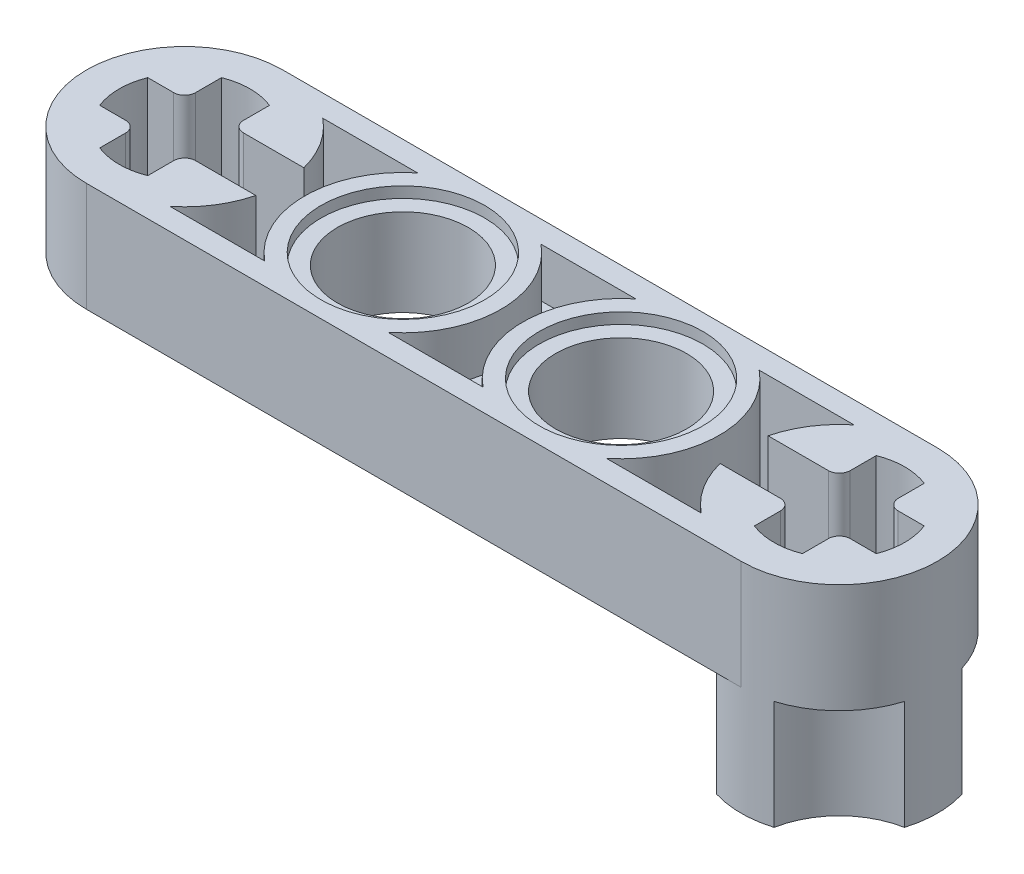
from build123d import *
from build123d.topology import SkipClean

# Parameters (mm, degrees)
SKETCH1_R           = 2.4
BOSS_EXTRUDE1_DEPTH = 4
CUT_EXTRUDE1_START  = -1.8
CUT_EXTRUDE1_DEPTH  = 1.8
SKETCH3_R           = 3
CUT_EXTRUDE2_DEPTH  = 0.4
BOSS_EXTRUDE2_START = 4
SKETCH4_R           = 2.4
BOSS_EXTRUDE2_DEPTH = 4


with BuildPart() as part:
    # Sketch1 → Boss-Extrude1 (new body)
    with BuildSketch(Plane(origin=(0, 0, 0), x_dir=(1, 0, 0), z_dir=(0, 1, 0))):
        with BuildLine():
            Line((-12, 3.6), (12, 3.6))
            ThreePointArc((12, 3.6), (15.6, 0), (12, -3.6))
            Line((12, -3.6), (-12, -3.6))
            ThreePointArc((-12, -3.6), (-15.6, 0), (-12, 3.6))
        make_face()
        with Locations(Location((-4, 0, 0), (0, 0, 270))):
            Circle(SKETCH1_R, mode=Mode.SUBTRACT)
        with Locations(Location((4, 0, 0), (0, 0, 270))):
            Circle(SKETCH1_R, mode=Mode.SUBTRACT)
        with BuildLine():
            Line((-14.232845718, 0.88), (-13.28, 0.88))
            ThreePointArc((-13.28, 0.88), (-12.997157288, 0.997157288), (-12.88, 1.28))
            Line((-12.88, 1.28), (-12.88, 2.232845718))
            ThreePointArc((-12.88, 2.232845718), (-12, 2.4), (-11.12, 2.232845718))
            Line((-11.12, 2.232845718), (-11.12, 1.28))
            ThreePointArc((-11.12, 1.28), (-11.002842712, 0.997157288), (-10.72, 0.88))
            Line((-10.72, 0.88), (-9.767154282, 0.88))
            Line((-9.767154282, 0.88), (-8.509212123, 0.88))
            ThreePointArc((-8.509212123, 0.88), (-8.967282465, 1.939748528), (-9.7372583, 2.8))
            Line((-9.7372583, 2.8), (-6.2627417, 2.8))
            ThreePointArc((-6.2627417, 2.8), (-7.6, 0), (-6.2627417, -2.8))
            Line((-6.2627417, -2.8), (-9.7372583, -2.8))
            ThreePointArc((-9.7372583, -2.8), (-8.967282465, -1.939748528), (-8.509212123, -0.88))
            Line((-8.509212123, -0.88), (-9.767154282, -0.88))
            Line((-9.767154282, -0.88), (-10.72, -0.88))
            ThreePointArc((-10.72, -0.88), (-11.002842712, -0.997157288), (-11.12, -1.28))
            Line((-11.12, -1.28), (-11.12, -2.232845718))
            ThreePointArc((-11.12, -2.232845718), (-12, -2.4), (-12.88, -2.232845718))
            Line((-12.88, -2.232845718), (-12.88, -1.28))
            ThreePointArc((-12.88, -1.28), (-12.997157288, -0.997157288), (-13.28, -0.88))
            Line((-13.28, -0.88), (-14.232845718, -0.88))
            ThreePointArc((-14.232845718, -0.88), (-14.4, 0), (-14.232845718, 0.88))
        make_face(mode=Mode.SUBTRACT)
        with BuildLine():
            Line((11.12, 2.232845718), (11.12, 1.28))
            ThreePointArc((11.12, 1.28), (11.002842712, 0.997157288), (10.72, 0.88))
            Line((10.72, 0.88), (9.767154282, 0.88))
            Line((9.767154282, 0.88), (8.509212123, 0.88))
            ThreePointArc((8.509212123, 0.88), (8.967282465, 1.939748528), (9.7372583, 2.8))
            Line((9.7372583, 2.8), (6.2627417, 2.8))
            ThreePointArc((6.2627417, 2.8), (7.6, 0), (6.2627417, -2.8))
            Line((6.2627417, -2.8), (9.7372583, -2.8))
            ThreePointArc((9.7372583, -2.8), (8.967282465, -1.939748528), (8.509212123, -0.88))
            Line((8.509212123, -0.88), (9.767154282, -0.88))
            Line((9.767154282, -0.88), (10.72, -0.88))
            ThreePointArc((10.72, -0.88), (11.002842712, -0.997157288), (11.12, -1.28))
            Line((11.12, -1.28), (11.12, -2.232845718))
            ThreePointArc((11.12, -2.232845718), (12, -2.4), (12.88, -2.232845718))
            Line((12.88, -2.232845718), (12.88, -1.28))
            ThreePointArc((12.88, -1.28), (12.997157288, -0.997157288), (13.28, -0.88))
            Line((13.28, -0.88), (14.232845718, -0.88))
            ThreePointArc((14.232845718, -0.88), (14.4, 0), (14.232845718, 0.88))
            Line((14.232845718, 0.88), (13.28, 0.88))
            ThreePointArc((13.28, 0.88), (12.997157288, 0.997157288), (12.88, 1.28))
            Line((12.88, 1.28), (12.88, 2.232845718))
            ThreePointArc((12.88, 2.232845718), (12, 2.4), (11.12, 2.232845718))
        make_face(mode=Mode.SUBTRACT)
    extrude(amount=BOSS_EXTRUDE1_DEPTH)

    # Sketch2 → Cut-Extrude1 (cut)
    with BuildSketch(Plane(origin=(0, 4, 0), x_dir=(1, 0, 0), z_dir=(0, 1, 0)).offset(CUT_EXTRUDE1_START)):
        with BuildLine():
            Line((-1.7372583, 2.8), (1.7372583, 2.8))
            ThreePointArc((1.7372583, 2.8), (0.4, 0), (1.7372583, -2.8))
            Line((1.7372583, -2.8), (-1.7372583, -2.8))
            ThreePointArc((-1.7372583, -2.8), (-0.4, 0), (-1.7372583, 2.8))
        make_face()
    cut_extrude1 = extrude(amount=CUT_EXTRUDE1_DEPTH, mode=Mode.SUBTRACT)

    # Mirror1: Cut-Extrude1 across plane
    add(cut_extrude1.mirror(Plane(origin=(0, 2, 0), x_dir=(0, 0, 1), z_dir=(0, -1, 0))), mode=Mode.SUBTRACT)

    # Sketch3 → Cut-Extrude2 (cut)
    with BuildSketch(Plane.XZ):
        with Locations(Location((-4, 0, 0), (0, 0, 270))):
            Circle(SKETCH3_R)
        with Locations(Location((4, 0, 0), (0, 0, 270))):
            Circle(SKETCH3_R)
    cut_extrude2 = extrude(amount=-CUT_EXTRUDE2_DEPTH, mode=Mode.SUBTRACT)

    # Mirror2: Cut-Extrude2 across plane
    add(cut_extrude2.mirror(Plane(origin=(0, 2, 0), x_dir=(0, 0, 1), z_dir=(0, -1, 0))), mode=Mode.SUBTRACT)

    # Sketch4 → Boss-Extrude2 (add)
    with SkipClean():  # the faces are left unmerged after this step: merging them gives an invalid solid
        with BuildSketch(Plane.XZ.offset(BOSS_EXTRUDE2_START)):
            with BuildLine():
                ThreePointArc((13.052199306, 3.442800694), (12, 3.6), (10.947800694, 3.442800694))
                ThreePointArc((10.947800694, 3.442800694), (10.121320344, 1.878679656), (8.557199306, 1.052199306))
                ThreePointArc((8.557199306, 1.052199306), (8.4, 0), (8.557199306, -1.052199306))
                ThreePointArc((8.557199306, -1.052199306), (10.121320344, -1.878679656), (10.947800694, -3.442800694))
                ThreePointArc((10.947800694, -3.442800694), (12, -3.6), (13.052199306, -3.442800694))
                ThreePointArc((13.052199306, -3.442800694), (13.878679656, -1.878679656), (15.442800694, -1.052199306))
                ThreePointArc((15.442800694, -1.052199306), (15.6, 0), (15.442800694, 1.052199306))
                ThreePointArc((15.442800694, 1.052199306), (13.878679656, 1.878679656), (13.052199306, 3.442800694))
            make_face()
            with Locations(Location((12, 0, 0), (0, 0, 270))):
                Circle(SKETCH4_R, mode=Mode.SUBTRACT)
        extrude(amount=-BOSS_EXTRUDE2_DEPTH)


solid = part.part
